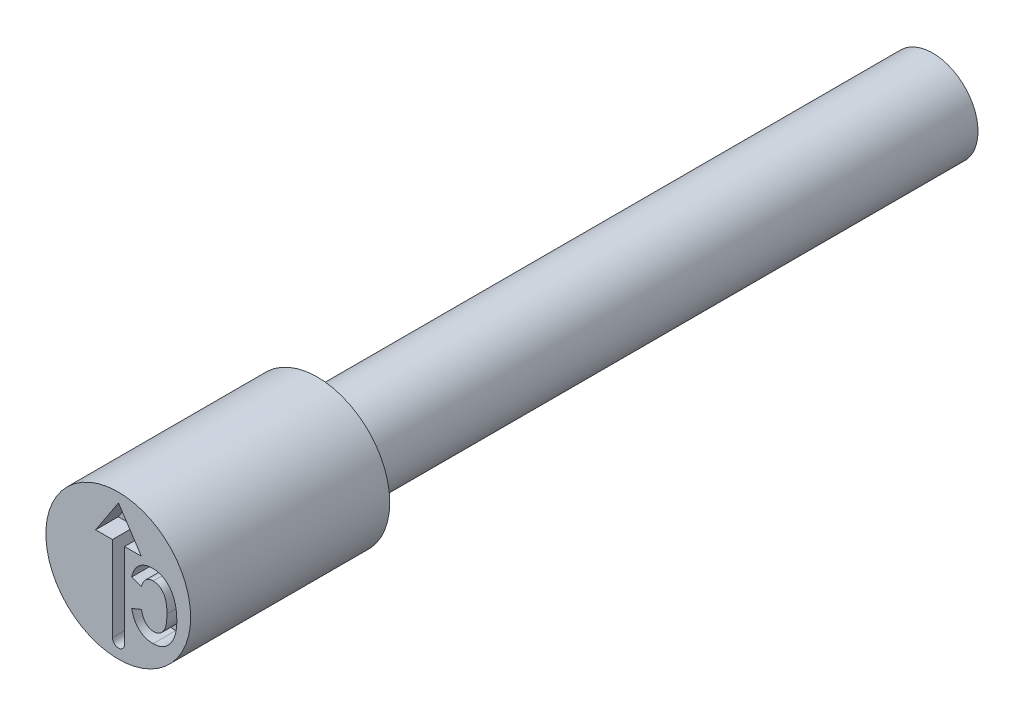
from build123d import *

# Parameters (mm, degrees)
CUT_EXTRUDE4_DEPTH = 0.25
CUT_EXTRUDE5_DEPTH = 0.25


with BuildPart() as part:
    # Sketch2 → Revolve1 (revolve)
    with BuildSketch(Plane(origin=(0, 0, 0), x_dir=(0, 0, -1), z_dir=(1, 0, 0)), mode=Mode.PRIVATE) as revolve1_sk:
        Polygon((0, 0.8), (0, 0), (9, 0), (9, 0.5), (2.2, 0.5), (2.2, 0.8), align=None)
    revolve(revolve1_sk.sketch.rotate(Axis((0, 0, -0.403888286), (0, 0, -1)), 90), axis=Axis((0, 0, -0.403888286), (0, 0, -1)))

    # Sketch3 → Cut-Extrude4 (cut)
    with BuildSketch(Plane.XY):
        with BuildLine():
            Line((0.069168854, 0.31237424), (0.069168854, -0.626505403))
            ThreePointArc((0.069168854, -0.626505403), (0.002503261, -0.693170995), (-0.064162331, -0.626505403))
            Line((-0.064162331, -0.626505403), (-0.064162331, 0.31237424))
            Line((-0.064162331, 0.31237424), (-0.250167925, 0.31237424))
            Line((-0.250167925, 0.31237424), (0.002503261, 0.69589161))
            Line((0.002503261, 0.69589161), (0.255174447, 0.31237424))
            Line((0.255174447, 0.31237424), (0.069168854, 0.31237424))
        make_face()
    extrude(amount=-CUT_EXTRUDE4_DEPTH, mode=Mode.SUBTRACT)

    # Sketch4 → Cut-Extrude5 (cut)
    with BuildSketch(Plane.XY):
        with BuildLine():
            Line((0.256495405, -0.195454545), (0.147404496, -0.240909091))
            add(Edge.make_bspline(
                [(0.147404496, -0.240909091), (0.149657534, -0.250079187), (0.15404769, -0.267947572), (0.162353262, -0.293486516), (0.171492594, -0.317182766), (0.181948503, -0.338903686), (0.193362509, -0.35883984), (0.206041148, -0.37679505), (0.219745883, -0.392861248), (0.234554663, -0.407000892), (0.25044347, -0.419166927), (0.26696619, -0.430008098), (0.284549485, -0.43889555), (0.302947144, -0.446399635), (0.322303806, -0.451977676), (0.342472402, -0.456175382), (0.363539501, -0.458577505), (0.377891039, -0.458917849), (0.385188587, -0.459090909)],
                knots=[0, 0, 0, 0, 1.282586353, 2.499182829, 3.646034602, 4.730797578, 5.771318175, 6.763713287, 7.712684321, 8.6363956, 9.539720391, 10.428356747, 11.317388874, 12.212151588, 13.124116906, 14.050177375, 15.008543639, 16, 16, 16, 16], degree=3))
            add(Edge.make_bspline(
                [(0.385188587, -0.459090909), (0.394344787, -0.458885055), (0.412281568, -0.458481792), (0.438454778, -0.454142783), (0.463360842, -0.447550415), (0.486954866, -0.438083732), (0.509264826, -0.425983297), (0.530055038, -0.410995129), (0.549810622, -0.393677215), (0.561297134, -0.380174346), (0.567148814, -0.373295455)],
                knots=[0, 0, 0, 0, 1.053414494, 2.063614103, 3.046293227, 4.01520277, 4.983805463, 5.961130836, 6.961320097, 8, 8, 8, 8], degree=3))
            add(Edge.make_bspline(
                [(0.567148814, -0.373295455), (0.573580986, -0.3648026), (0.58653919, -0.347692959), (0.602807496, -0.319479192), (0.616644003, -0.289168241), (0.627968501, -0.256732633), (0.63679535, -0.222136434), (0.642966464, -0.185363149), (0.646672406, -0.146430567), (0.647156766, -0.119752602), (0.647404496, -0.106107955)],
                knots=[0, 0, 0, 0, 0.898140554, 1.809387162, 2.740718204, 3.705966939, 4.703925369, 5.74945803, 6.848943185, 8, 8, 8, 8], degree=3))
            add(Edge.make_bspline(
                [(0.647404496, -0.106107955), (0.647178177, -0.0917041), (0.646737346, -0.063647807), (0.64276833, -0.022800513), (0.636717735, 0.015708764), (0.627696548, 0.051736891), (0.616395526, 0.085490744), (0.602433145, 0.116759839), (0.586221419, 0.145871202), (0.572994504, 0.16325749), (0.566438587, 0.171875)],
                knots=[0, 0, 0, 0, 1.171098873, 2.281104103, 3.334483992, 4.338438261, 5.297974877, 6.225356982, 7.120398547, 8, 8, 8, 8], degree=3))
            add(Edge.make_bspline(
                [(0.566438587, 0.171875), (0.560486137, 0.178840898), (0.548755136, 0.192569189), (0.528704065, 0.210346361), (0.50716292, 0.225457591), (0.484139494, 0.237829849), (0.459530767, 0.247452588), (0.43345718, 0.254242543), (0.405814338, 0.258248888), (0.38690642, 0.258805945), (0.377234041, 0.259090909)],
                knots=[0, 0, 0, 0, 1.017460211, 2.005195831, 2.96880208, 3.936538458, 4.903086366, 5.898753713, 6.925103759, 8, 8, 8, 8], degree=3))
            add(Edge.make_bspline(
                [(0.377234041, 0.259090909), (0.369318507, 0.25890144), (0.353760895, 0.258529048), (0.330948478, 0.255551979), (0.309214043, 0.250317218), (0.288345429, 0.243450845), (0.268525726, 0.23426371), (0.249697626, 0.223115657), (0.231787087, 0.210043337), (0.220931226, 0.199880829), (0.215444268, 0.194744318)],
                knots=[0, 0, 0, 0, 1.062174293, 2.087653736, 3.080296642, 4.058948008, 5.03139012, 6.005719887, 6.992016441, 8, 8, 8, 8], degree=3))
            add(Edge.make_bspline(
                [(0.215444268, 0.194744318), (0.21162924, 0.190785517), (0.203855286, 0.182718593), (0.193387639, 0.169130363), (0.183696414, 0.154165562), (0.174955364, 0.137760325), (0.166829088, 0.120074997), (0.159439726, 0.101018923), (0.152939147, 0.080548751), (0.14927788, 0.066354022), (0.147404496, 0.059090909)],
                knots=[0, 0, 0, 0, 0.858002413, 1.748367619, 2.673305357, 3.63929672, 4.648357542, 5.711115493, 6.828831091, 8, 8, 8, 8], degree=3))
            Line((0.147404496, 0.059090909), (0.256495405, 0.022727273))
            add(Edge.make_bspline(
                [(0.256495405, 0.022727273), (0.257520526, 0.027383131), (0.259515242, 0.036442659), (0.263520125, 0.049516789), (0.268395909, 0.061660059), (0.273700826, 0.073163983), (0.280088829, 0.083630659), (0.286770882, 0.093560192), (0.294606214, 0.102357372), (0.302884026, 0.110484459), (0.311896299, 0.117507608), (0.32112117, 0.123858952), (0.330833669, 0.129139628), (0.340993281, 0.133386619), (0.351479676, 0.136823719), (0.362370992, 0.139240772), (0.373642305, 0.140704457), (0.381301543, 0.140840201), (0.385188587, 0.140909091)],
                knots=[0, 0, 0, 0, 1.200071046, 2.335138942, 3.437621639, 4.493482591, 5.51985659, 6.521917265, 7.50210956, 8.480124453, 9.438987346, 10.374745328, 11.297656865, 12.216555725, 13.143999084, 14.072438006, 15.021767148, 16, 16, 16, 16], degree=3))
            add(Edge.make_bspline(
                [(0.385188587, 0.140909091), (0.390689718, 0.140745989), (0.401516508, 0.140424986), (0.417378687, 0.137871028), (0.432386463, 0.133353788), (0.446765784, 0.127423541), (0.460275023, 0.119522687), (0.47306457, 0.10995464), (0.484790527, 0.09843025), (0.49602862, 0.085467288), (0.506212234, 0.070448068), (0.514858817, 0.053089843), (0.521990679, 0.033454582), (0.528133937, 0.011683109), (0.532730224, -0.012367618), (0.535919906, -0.038660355), (0.537910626, -0.067156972), (0.538176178, -0.0869284), (0.538313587, -0.097159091)],
                knots=[0, 0, 0, 0, 0.827686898, 1.628972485, 2.409099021, 3.181967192, 3.964173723, 4.757978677, 5.579415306, 6.433460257, 7.33665582, 8.302235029, 9.343905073, 10.476376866, 11.703364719, 13.024698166, 14.460435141, 16, 16, 16, 16], degree=3))
            add(Edge.make_bspline(
                [(0.538313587, -0.097159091), (0.538158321, -0.10776711), (0.537859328, -0.128194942), (0.536116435, -0.157699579), (0.53280361, -0.184807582), (0.528562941, -0.209625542), (0.522759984, -0.232008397), (0.515670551, -0.251969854), (0.507504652, -0.26970479), (0.497763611, -0.284980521), (0.486970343, -0.298168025), (0.475495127, -0.309617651), (0.463116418, -0.31918222), (0.450165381, -0.327288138), (0.436286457, -0.333430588), (0.42164384, -0.337609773), (0.406324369, -0.340500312), (0.395808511, -0.340771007), (0.390444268, -0.340909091)],
                knots=[0, 0, 0, 0, 1.588381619, 3.058741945, 4.422565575, 5.675514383, 6.825848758, 7.879737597, 8.8437938, 9.742560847, 10.584031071, 11.391113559, 12.163968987, 12.921455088, 13.673648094, 14.427376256, 15.197789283, 16, 16, 16, 16], degree=3))
            add(Edge.make_bspline(
                [(0.390444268, -0.340909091), (0.386510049, -0.340787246), (0.378705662, -0.340545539), (0.367221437, -0.339006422), (0.356139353, -0.33625451), (0.345457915, -0.332436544), (0.335222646, -0.327399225), (0.325328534, -0.321431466), (0.315975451, -0.314258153), (0.306920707, -0.30611321), (0.298380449, -0.296745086), (0.290575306, -0.285974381), (0.283323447, -0.273993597), (0.276668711, -0.26072843), (0.270568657, -0.246264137), (0.265190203, -0.230489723), (0.260323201, -0.213483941), (0.257795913, -0.201580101), (0.256495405, -0.195454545)],
                knots=[0, 0, 0, 0, 0.874040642, 1.73385169, 2.568061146, 3.406503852, 4.248567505, 5.09821747, 5.96915136, 6.862782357, 7.800986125, 8.779254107, 9.812897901, 10.908933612, 12.073249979, 13.297367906, 14.609261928, 16, 16, 16, 16], degree=3))
        make_face()
    extrude(amount=-CUT_EXTRUDE5_DEPTH, mode=Mode.SUBTRACT)


solid = part.part
